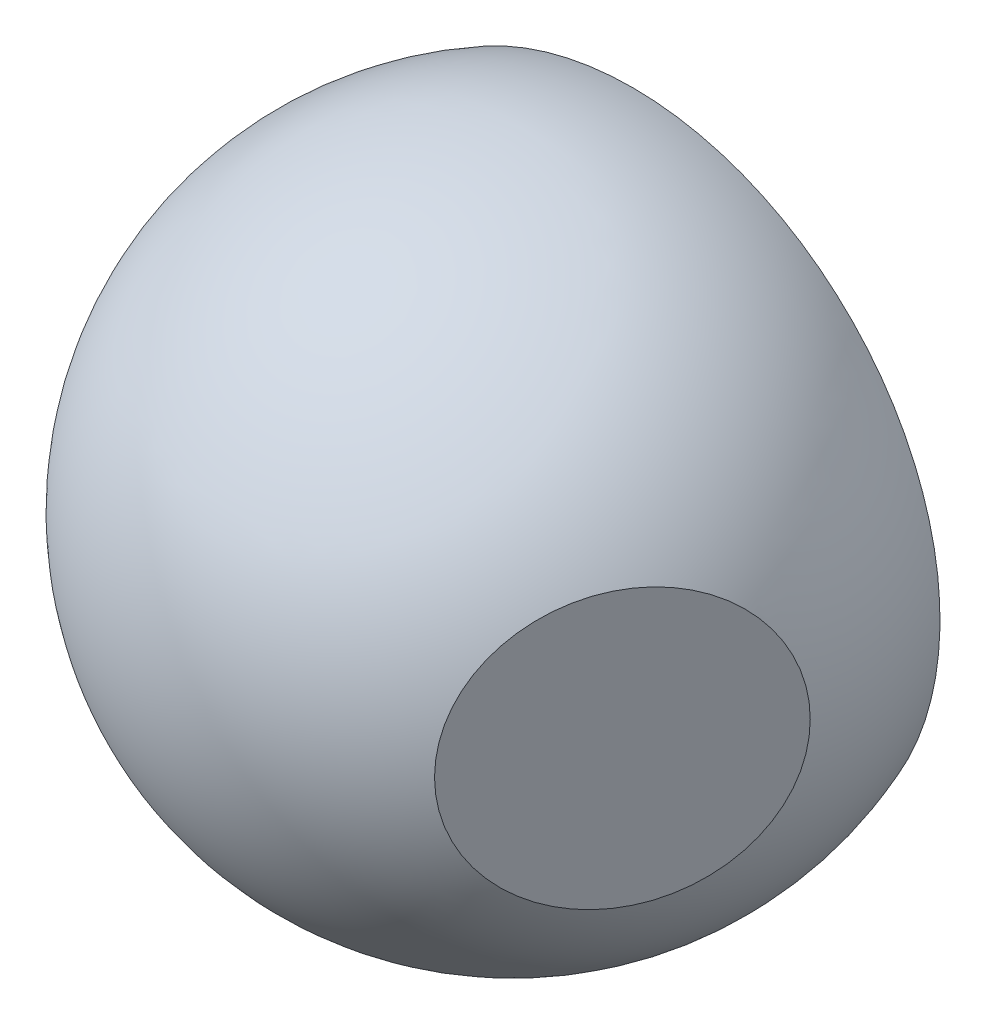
ISO-10303-21;
HEADER;
FILE_DESCRIPTION(('STEP AP214'),'2;1');
FILE_NAME('part.step','',(''),(''),'','','');
FILE_SCHEMA(('AUTOMOTIVE_DESIGN { 1 0 10303 214 1 1 1 1 }'));
ENDSEC;
DATA;
#1=APPLICATION_CONTEXT('core data for automotive mechanical design processes');
#2=APPLICATION_PROTOCOL_DEFINITION('international standard','automotive_design',2000,#1);
#3=PRODUCT_CONTEXT('',#1,'mechanical');
#4=PRODUCT('Part','Part','',(#3));
#5=PRODUCT_RELATED_PRODUCT_CATEGORY('part','',(#4));
#6=PRODUCT_DEFINITION_FORMATION('','',#4);
#7=PRODUCT_DEFINITION_CONTEXT('part definition',#1,'design');
#8=PRODUCT_DEFINITION('design','',#6,#7);
#9=PRODUCT_DEFINITION_SHAPE('','',#8);
#10=(LENGTH_UNIT() NAMED_UNIT(*) SI_UNIT(.MILLI.,.METRE.));
#11=(NAMED_UNIT(*) PLANE_ANGLE_UNIT() SI_UNIT($,.RADIAN.));
#12=(NAMED_UNIT(*) SI_UNIT($,.STERADIAN.) SOLID_ANGLE_UNIT());
#13=UNCERTAINTY_MEASURE_WITH_UNIT(LENGTH_MEASURE(1.E-05),#10,'distance_accuracy_value','');
#14=(GEOMETRIC_REPRESENTATION_CONTEXT(3) GLOBAL_UNCERTAINTY_ASSIGNED_CONTEXT((#13)) GLOBAL_UNIT_ASSIGNED_CONTEXT((#10,
#11,#12)) REPRESENTATION_CONTEXT('',''));
#15=CARTESIAN_POINT('',(0.,0.,0.));
#16=DIRECTION('',(0.,0.,1.));
#17=DIRECTION('',(1.,0.,0.));
#18=AXIS2_PLACEMENT_3D('',#15,#16,#17);
#19=CARTESIAN_POINT('',(0.,23.8273528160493,-20.2273528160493));
#20=DIRECTION('',(0.,0.,-1.));
#21=DIRECTION('',(0.,1.,0.));
#22=AXIS2_PLACEMENT_3D('',#19,#20,#21);
#23=PLANE('',#22);
#24=CARTESIAN_POINT('',(0.,23.8273528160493,-20.2273528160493));
#25=DIRECTION('',(0.,0.,-1.));
#26=DIRECTION('',(0.,1.,0.));
#27=AXIS2_PLACEMENT_3D('',#24,#25,#26);
#28=CIRCLE('',#27,20.75);
#29=CARTESIAN_POINT('',(0.,44.5773528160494,-20.2273528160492));
#30=VERTEX_POINT('',#29);
#31=EDGE_CURVE('E56',#30,#30,#28,.T.);
#32=ORIENTED_EDGE('',*,*,#31,.F.);
#33=EDGE_LOOP('',(#32));
#34=FACE_BOUND('',#33,.T.);
#35=ADVANCED_FACE('F50',(#34),#23,.F.);
#36=CARTESIAN_POINT('',(0.,23.8273528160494,-22.0273528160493));
#37=DIRECTION('',(0.,0.,1.));
#38=DIRECTION('',(0.,-1.,0.));
#39=AXIS2_PLACEMENT_3D('',#36,#37,#38);
#40=PLANE('',#39);
#41=CARTESIAN_POINT('',(0.,23.8273528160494,-22.0273528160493));
#42=DIRECTION('',(0.,0.,-1.));
#43=DIRECTION('',(0.,1.,0.));
#44=AXIS2_PLACEMENT_3D('',#41,#42,#43);
#45=CIRCLE('',#44,20.75);
#46=CARTESIAN_POINT('',(0.,44.5773528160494,-22.0273528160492));
#47=VERTEX_POINT('',#46);
#48=EDGE_CURVE('E11',#47,#47,#45,.T.);
#49=ORIENTED_EDGE('',*,*,#48,.T.);
#50=EDGE_LOOP('',(#49));
#51=FACE_BOUND('',#50,.T.);
#52=ADVANCED_FACE('F65',(#51),#40,.F.);
#53=CARTESIAN_POINT('',(0.,23.8273528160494,-23.8273528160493));
#54=DIRECTION('',(0.,0.,-1.));
#55=DIRECTION('',(0.,1.,0.));
#56=AXIS2_PLACEMENT_3D('',#53,#54,#55);
#57=CYLINDRICAL_SURFACE('',#56,20.75);
#58=ORIENTED_EDGE('',*,*,#48,.F.);
#59=EDGE_LOOP('',(#58));
#60=FACE_BOUND('',#59,.T.);
#61=ORIENTED_EDGE('',*,*,#31,.T.);
#62=EDGE_LOOP('',(#61));
#63=FACE_BOUND('',#62,.T.);
#64=ADVANCED_FACE('F62',(#60,#63),#57,.T.);
#65=CLOSED_SHELL('',(#35,#52,#64));
#66=MANIFOLD_SOLID_BREP('B2_NOT_SHOWN',#65);
#67=CARTESIAN_POINT('',(0.,23.8273528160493,0.172647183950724));
#68=DIRECTION('',(0.,0.,-1.));
#69=DIRECTION('',(-1.,0.,0.));
#70=AXIS2_PLACEMENT_3D('',#67,#68,#69);
#71=SPHERICAL_SURFACE('',#70,65.9094112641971);
#72=CARTESIAN_POINT('',(0.,23.8273528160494,-23.8273528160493));
#73=DIRECTION('',(0.,0.,-1.));
#74=DIRECTION('',(0.,1.,0.));
#75=AXIS2_PLACEMENT_3D('',#72,#73,#74);
#76=CIRCLE('',#75,61.3844483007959);
#77=CARTESIAN_POINT('',(0.,85.2118011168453,-23.8273528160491));
#78=VERTEX_POINT('',#77);
#79=EDGE_CURVE('E49',#78,#78,#76,.T.);
#80=ORIENTED_EDGE('',*,*,#79,.F.);
#81=EDGE_LOOP('',(#80));
#82=FACE_BOUND('',#81,.T.);
#83=CARTESIAN_POINT('',(51.8830720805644,23.8273528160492,30.1273528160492));
#84=DIRECTION('',(-0.86602540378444,0.,-0.499999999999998));
#85=DIRECTION('',(0.499999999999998,0.,-0.86602540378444));
#86=AXIS2_PLACEMENT_3D('',#83,#84,#85);
#87=CIRCLE('',#86,27.4756789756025);
#88=CARTESIAN_POINT('',(65.6209115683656,23.8273528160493,6.33271683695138));
#89=VERTEX_POINT('',#88);
#90=EDGE_CURVE('E111',#89,#89,#87,.T.);
#91=ORIENTED_EDGE('',*,*,#90,.T.);
#92=EDGE_LOOP('',(#91));
#93=FACE_BOUND('',#92,.T.);
#94=ADVANCED_FACE('F103',(#82,#93),#71,.T.);
#95=CARTESIAN_POINT('',(0.,23.8273528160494,-23.8273528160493));
#96=DIRECTION('',(0.,0.,1.));
#97=DIRECTION('',(0.,-1.,0.));
#98=AXIS2_PLACEMENT_3D('',#95,#96,#97);
#99=PLANE('',#98);
#100=ORIENTED_EDGE('',*,*,#79,.T.);
#101=EDGE_LOOP('',(#100));
#102=FACE_BOUND('',#101,.T.);
#103=ADVANCED_FACE('F143',(#102),#99,.F.);
#104=CARTESIAN_POINT('',(0.,89.736764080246,119.991469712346));
#105=DIRECTION('',(-0.86602540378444,0.,-0.499999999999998));
#106=DIRECTION('',(0.499999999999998,0.,-0.86602540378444));
#107=AXIS2_PLACEMENT_3D('',#104,#105,#106);
#108=PLANE('',#107);
#109=ORIENTED_EDGE('',*,*,#90,.F.);
#110=EDGE_LOOP('',(#109));
#111=FACE_BOUND('',#110,.T.);
#112=ADVANCED_FACE('F142',(#111),#108,.F.);
#113=CLOSED_SHELL('',(#94,#103,#112));
#114=CARTESIAN_POINT('',(-4.15692193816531,89.736764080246,117.591469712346));
#115=DIRECTION('',(-0.86602540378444,0.,-0.499999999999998));
#116=DIRECTION('',(0.499999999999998,0.,-0.86602540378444));
#117=AXIS2_PLACEMENT_3D('',#114,#115,#116);
#118=PLANE('',#117);
#119=CARTESIAN_POINT('',(47.7261501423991,23.8273528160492,27.7273528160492));
#120=DIRECTION('',(-0.86602540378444,0.,-0.499999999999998));
#121=DIRECTION('',(0.499999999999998,0.,-0.86602540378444));
#122=AXIS2_PLACEMENT_3D('',#119,#120,#121);
#123=CIRCLE('',#122,26.4066835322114);
#124=CARTESIAN_POINT('',(60.9294919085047,23.8273528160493,4.85849404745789));
#125=VERTEX_POINT('',#124);
#126=EDGE_CURVE('E116',#125,#125,#123,.T.);
#127=ORIENTED_EDGE('',*,*,#126,.T.);
#128=EDGE_LOOP('',(#127));
#129=FACE_BOUND('',#128,.T.);
#130=ADVANCED_FACE('F133',(#129),#118,.T.);
#131=CARTESIAN_POINT('',(0.,23.8273528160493,0.172647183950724));
#132=DIRECTION('',(0.,0.,-1.));
#133=DIRECTION('',(-1.,0.,0.));
#134=AXIS2_PLACEMENT_3D('',#131,#132,#133);
#135=SPHERICAL_SURFACE('',#134,61.1094112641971);
#136=ORIENTED_EDGE('',*,*,#126,.F.);
#137=EDGE_LOOP('',(#136));
#138=FACE_BOUND('',#137,.T.);
#139=CARTESIAN_POINT('',(0.,23.8273528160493,-20.2273528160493));
#140=DIRECTION('',(0.,0.,-1.));
#141=DIRECTION('',(0.,1.,0.));
#142=AXIS2_PLACEMENT_3D('',#139,#140,#141);
#143=CIRCLE('',#142,57.6038205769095);
#144=CARTESIAN_POINT('',(0.,81.4311733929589,-20.2273528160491));
#145=VERTEX_POINT('',#144);
#146=EDGE_CURVE('E106',#145,#145,#143,.T.);
#147=ORIENTED_EDGE('',*,*,#146,.T.);
#148=EDGE_LOOP('',(#147));
#149=FACE_BOUND('',#148,.T.);
#150=ADVANCED_FACE('F124',(#138,#149),#135,.F.);
#151=CARTESIAN_POINT('',(0.,23.8273528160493,-20.2273528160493));
#152=DIRECTION('',(0.,0.,-1.));
#153=DIRECTION('',(0.,1.,0.));
#154=AXIS2_PLACEMENT_3D('',#151,#152,#153);
#155=PLANE('',#154);
#156=ORIENTED_EDGE('',*,*,#146,.F.);
#157=EDGE_LOOP('',(#156));
#158=FACE_BOUND('',#157,.T.);
#159=ADVANCED_FACE('F126',(#158),#155,.F.);
#160=CLOSED_SHELL('',(#130,#150,#159));
#161=ORIENTED_CLOSED_SHELL('',*,#160,.T.);
#162=BREP_WITH_VOIDS('B6',#113,(#161));
#163=ADVANCED_BREP_SHAPE_REPRESENTATION('',(#18,#66,#162),#14);
#164=SHAPE_DEFINITION_REPRESENTATION(#9,#163);
ENDSEC;
END-ISO-10303-21;
